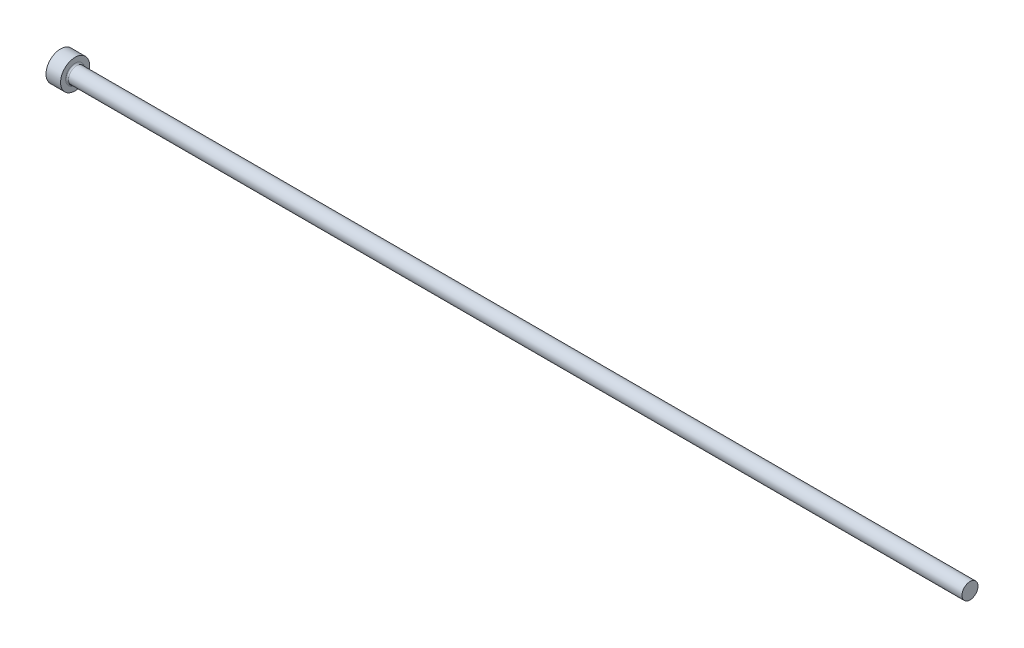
ISO-10303-21;
HEADER;
FILE_DESCRIPTION(('STEP AP214'),'2;1');
FILE_NAME('part.step','',(''),(''),'','','');
FILE_SCHEMA(('AUTOMOTIVE_DESIGN { 1 0 10303 214 1 1 1 1 }'));
ENDSEC;
DATA;
#1=APPLICATION_CONTEXT('core data for automotive mechanical design processes');
#2=APPLICATION_PROTOCOL_DEFINITION('international standard','automotive_design',2000,#1);
#3=PRODUCT_CONTEXT('',#1,'mechanical');
#4=PRODUCT('Part','Part','',(#3));
#5=PRODUCT_RELATED_PRODUCT_CATEGORY('part','',(#4));
#6=PRODUCT_DEFINITION_FORMATION('','',#4);
#7=PRODUCT_DEFINITION_CONTEXT('part definition',#1,'design');
#8=PRODUCT_DEFINITION('design','',#6,#7);
#9=PRODUCT_DEFINITION_SHAPE('','',#8);
#10=(LENGTH_UNIT() NAMED_UNIT(*) SI_UNIT(.MILLI.,.METRE.));
#11=(NAMED_UNIT(*) PLANE_ANGLE_UNIT() SI_UNIT($,.RADIAN.));
#12=(NAMED_UNIT(*) SI_UNIT($,.STERADIAN.) SOLID_ANGLE_UNIT());
#13=UNCERTAINTY_MEASURE_WITH_UNIT(LENGTH_MEASURE(1.E-05),#10,'distance_accuracy_value','');
#14=(GEOMETRIC_REPRESENTATION_CONTEXT(3) GLOBAL_UNCERTAINTY_ASSIGNED_CONTEXT((#13)) GLOBAL_UNIT_ASSIGNED_CONTEXT((#10,
#11,#12)) REPRESENTATION_CONTEXT('',''));
#15=CARTESIAN_POINT('',(0.,0.,0.));
#16=DIRECTION('',(0.,0.,1.));
#17=DIRECTION('',(1.,0.,0.));
#18=AXIS2_PLACEMENT_3D('',#15,#16,#17);
#19=CARTESIAN_POINT('',(0.,0.,0.));
#20=DIRECTION('',(-1.,0.,0.));
#21=DIRECTION('',(0.,-1.,0.));
#22=AXIS2_PLACEMENT_3D('',#19,#20,#21);
#23=PLANE('',#22);
#24=CARTESIAN_POINT('',(0.,0.,0.));
#25=DIRECTION('',(1.,0.,0.));
#26=DIRECTION('',(0.,1.,0.));
#27=AXIS2_PLACEMENT_3D('',#24,#25,#26);
#28=CIRCLE('',#27,2.);
#29=CARTESIAN_POINT('',(0.,2.,0.));
#30=VERTEX_POINT('',#29);
#31=EDGE_CURVE('E25',#30,#30,#28,.T.);
#32=ORIENTED_EDGE('',*,*,#31,.F.);
#33=EDGE_LOOP('',(#32));
#34=FACE_BOUND('',#33,.T.);
#35=ADVANCED_FACE('F14',(#34),#23,.T.);
#36=CARTESIAN_POINT('',(125.,0.,0.));
#37=DIRECTION('',(1.,0.,0.));
#38=DIRECTION('',(0.,1.,0.));
#39=AXIS2_PLACEMENT_3D('',#36,#37,#38);
#40=CYLINDRICAL_SURFACE('',#39,2.);
#41=ORIENTED_EDGE('',*,*,#31,.T.);
#42=EDGE_LOOP('',(#41));
#43=FACE_BOUND('',#42,.T.);
#44=CARTESIAN_POINT('',(2.,0.,0.));
#45=DIRECTION('',(1.,0.,0.));
#46=DIRECTION('',(0.,1.,0.));
#47=AXIS2_PLACEMENT_3D('',#44,#45,#46);
#48=CIRCLE('',#47,2.);
#49=CARTESIAN_POINT('',(2.,2.,0.));
#50=VERTEX_POINT('',#49);
#51=EDGE_CURVE('E29',#50,#50,#48,.T.);
#52=ORIENTED_EDGE('',*,*,#51,.F.);
#53=EDGE_LOOP('',(#52));
#54=FACE_BOUND('',#53,.T.);
#55=ADVANCED_FACE('F51',(#43,#54),#40,.T.);
#56=CARTESIAN_POINT('',(2.,2.,0.));
#57=DIRECTION('',(1.,0.,0.));
#58=DIRECTION('',(0.,1.,0.));
#59=AXIS2_PLACEMENT_3D('',#56,#57,#58);
#60=PLANE('',#59);
#61=CARTESIAN_POINT('',(2.,0.,0.));
#62=DIRECTION('',(1.,0.,0.));
#63=DIRECTION('',(0.,1.,0.));
#64=AXIS2_PLACEMENT_3D('',#61,#62,#63);
#65=CIRCLE('',#64,1.29999999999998);
#66=CARTESIAN_POINT('',(2.,1.29999999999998,0.));
#67=VERTEX_POINT('',#66);
#68=EDGE_CURVE('E9',#67,#67,#65,.F.);
#69=ORIENTED_EDGE('',*,*,#68,.T.);
#70=EDGE_LOOP('',(#69));
#71=FACE_BOUND('',#70,.T.);
#72=ORIENTED_EDGE('',*,*,#51,.T.);
#73=EDGE_LOOP('',(#72));
#74=FACE_BOUND('',#73,.T.);
#75=ADVANCED_FACE('F42',(#71,#74),#60,.T.);
#76=CARTESIAN_POINT('',(125.,0.,0.));
#77=DIRECTION('',(1.,0.,0.));
#78=DIRECTION('',(0.,1.,0.));
#79=AXIS2_PLACEMENT_3D('',#76,#77,#78);
#80=CYLINDRICAL_SURFACE('',#79,1.09999999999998);
#81=CARTESIAN_POINT('',(2.2,0.,0.));
#82=DIRECTION('',(1.,0.,0.));
#83=DIRECTION('',(0.,1.,0.));
#84=AXIS2_PLACEMENT_3D('',#81,#82,#83);
#85=CIRCLE('',#84,1.09999999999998);
#86=CARTESIAN_POINT('',(2.2,1.09999999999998,0.));
#87=VERTEX_POINT('',#86);
#88=EDGE_CURVE('E21',#87,#87,#85,.T.);
#89=ORIENTED_EDGE('',*,*,#88,.T.);
#90=EDGE_LOOP('',(#89));
#91=FACE_BOUND('',#90,.T.);
#92=CARTESIAN_POINT('',(125.,0.,0.));
#93=DIRECTION('',(1.,0.,0.));
#94=DIRECTION('',(0.,1.,0.));
#95=AXIS2_PLACEMENT_3D('',#92,#93,#94);
#96=CIRCLE('',#95,1.09999999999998);
#97=CARTESIAN_POINT('',(125.,1.09999999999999,0.));
#98=VERTEX_POINT('',#97);
#99=EDGE_CURVE('E34',#98,#98,#96,.T.);
#100=ORIENTED_EDGE('',*,*,#99,.F.);
#101=EDGE_LOOP('',(#100));
#102=FACE_BOUND('',#101,.T.);
#103=ADVANCED_FACE('F40',(#91,#102),#80,.T.);
#104=CARTESIAN_POINT('',(125.,1.09999999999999,0.));
#105=DIRECTION('',(1.,0.,0.));
#106=DIRECTION('',(0.,1.,0.));
#107=AXIS2_PLACEMENT_3D('',#104,#105,#106);
#108=PLANE('',#107);
#109=ORIENTED_EDGE('',*,*,#99,.T.);
#110=EDGE_LOOP('',(#109));
#111=FACE_BOUND('',#110,.T.);
#112=ADVANCED_FACE('F38',(#111),#108,.T.);
#113=CARTESIAN_POINT('',(2.2,0.,0.));
#114=DIRECTION('',(1.,0.,0.));
#115=DIRECTION('',(0.,1.,0.));
#116=AXIS2_PLACEMENT_3D('',#113,#114,#115);
#117=TOROIDAL_SURFACE('',#116,1.29999999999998,0.2);
#118=ORIENTED_EDGE('',*,*,#68,.F.);
#119=EDGE_LOOP('',(#118));
#120=FACE_BOUND('',#119,.T.);
#121=ORIENTED_EDGE('',*,*,#88,.F.);
#122=EDGE_LOOP('',(#121));
#123=FACE_BOUND('',#122,.T.);
#124=ADVANCED_FACE('F16',(#120,#123),#117,.F.);
#125=CLOSED_SHELL('',(#35,#55,#75,#103,#112,#124));
#126=MANIFOLD_SOLID_BREP('B1',#125);
#127=ADVANCED_BREP_SHAPE_REPRESENTATION('',(#18,#126),#14);
#128=SHAPE_DEFINITION_REPRESENTATION(#9,#127);
ENDSEC;
END-ISO-10303-21;
